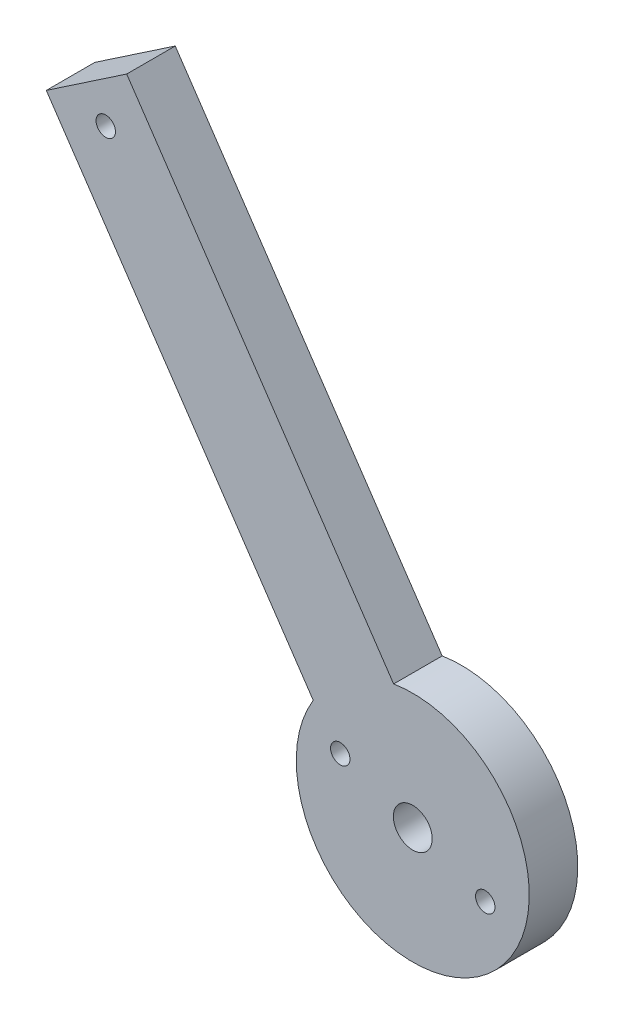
from build123d import *

# Parameters (mm, degrees)
BOSS_EXTRUDE1_DEPTH = 5
SKETCH2_R           = 2
SKETCH2_R_2         = 1
CUT_EXTRUDE1_DEPTH  = 5
SKETCH3_R           = 1
CUT_EXTRUDE2_DEPTH  = 5


with BuildPart() as part:
    # Sketch1 → Boss-Extrude1 (new body)
    with BuildSketch(Plane.XY):
        with BuildLine():
            Line((-10.252670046, 6.235603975), (-37.752452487, 46.901517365))
            Line((-37.752452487, 46.901517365), (-29.468719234, 52.503281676))
            Line((-29.468719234, 52.503281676), (-1.968936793, 11.837368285))
            ThreePointArc((-1.968936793, 11.837368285), (6.722117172, -9.940479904), (-10.252670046, 6.235603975))
        make_face()
    extrude(amount=BOSS_EXTRUDE1_DEPTH)

    # Sketch2 → Cut-Extrude1 (cut)
    with BuildSketch(Plane.XY.offset(5)):
        Circle(SKETCH2_R)
        with Locations((-31.629241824, 46.772443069)):
            Circle(SKETCH2_R_2)
    extrude(amount=-CUT_EXTRUDE1_DEPTH, mode=Mode.SUBTRACT)

    # Sketch3 → Cut-Extrude2 (cut)
    with BuildSketch(Plane.XY.offset(5)):
        with Locations((7.468643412, -2.866943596)):
            Circle(SKETCH3_R)
        with Locations((-7.468643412, 2.866943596)):
            Circle(SKETCH3_R)
    extrude(amount=-CUT_EXTRUDE2_DEPTH, mode=Mode.SUBTRACT)


solid = part.part
